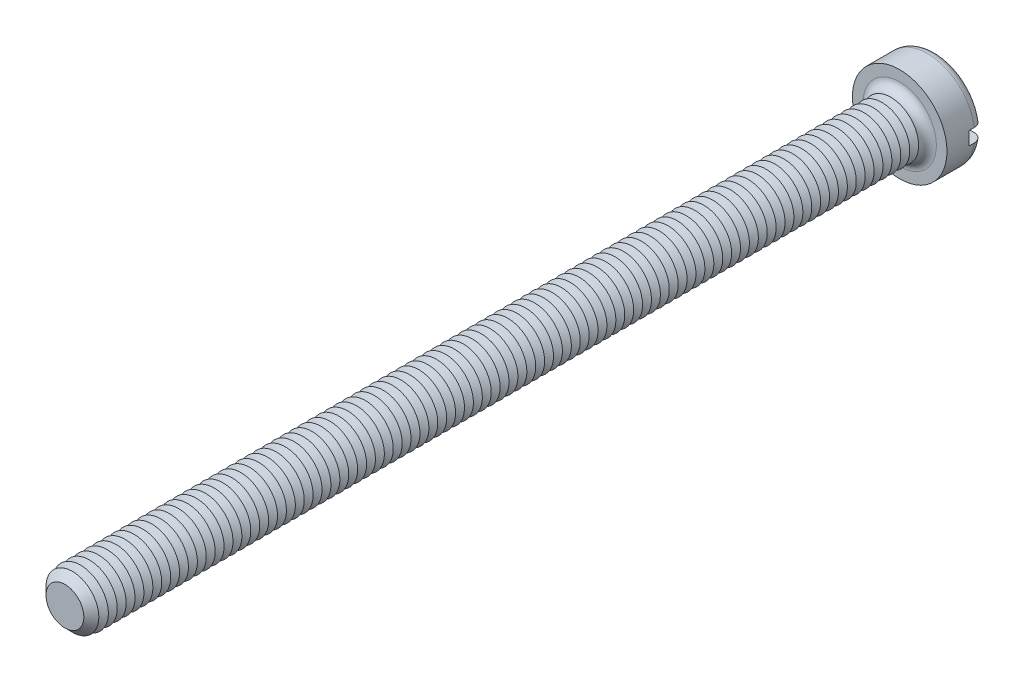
from build123d import *

# Parameters (mm, degrees)
SKETCH3_R           = 4.25
BOSS_EXTRUDE2_DEPTH = 3.3
SKETCH4_R           = 2.5
BOSS_EXTRUDE3_DEPTH = 75
FILLET1_R           = 0.8
CHAMFER1_SIZE       = 0.8
LPATTERN1_COUNT     = 92
LPATTERN1_PITCH     = 0.8
SKETCH8_W           = 8.5
SKETCH8_H           = 1.2
CUT_EXTRUDE1_DEPTH  = 1.3


with BuildPart() as part:
    # Sketch3 → Boss-Extrude2 (new body)
    with BuildSketch(Plane.XY):
        Circle(SKETCH3_R)
    extrude(amount=-BOSS_EXTRUDE2_DEPTH)

    # Sketch4 → Boss-Extrude3 (add)
    with BuildSketch(Plane.XY):
        Circle(SKETCH4_R)
    extrude(amount=BOSS_EXTRUDE3_DEPTH)

    # Fillet1
    fillet1_edges = [part.edges().sort_by_distance(p)[0] for p in [
        (-4.25, 0, -3.3),
        (-2.5, 0, 0),
    ]]
    fillet(fillet1_edges, radius=FILLET1_R)

    # Chamfer1
    chamfer1_edges = [part.edges().sort_by_distance(p)[0] for p in [
        (-2.5, 0, 75),
    ]]
    chamfer(chamfer1_edges, length=CHAMFER1_SIZE)

    # Sketch6 → Cut-Revolve1 (revolve, cut)
    with BuildSketch(Plane(origin=(0, 0, 0), x_dir=(0, 0, -1), z_dir=(1, 0, 0)), mode=Mode.PRIVATE) as cut_revolve1_sk:
        Polygon((-0.8, 2.5), (-1.2, 1.807179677), (-1.6, 2.5), align=None)
    cut_revolve1 = revolve(cut_revolve1_sk.sketch.rotate(Axis((0, 0, -1.694361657), (0, 0, 1)), 90), axis=Axis((0, 0, -1.694361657), (0, 0, 1)), mode=Mode.SUBTRACT)

    # LPattern1: Cut-Revolve1 ×92
    with Locations(*[(0, 0, i * LPATTERN1_PITCH) for i in range(1, LPATTERN1_COUNT)]):
        add(cut_revolve1, mode=Mode.SUBTRACT)

    # Sketch8 → Cut-Extrude1 (cut)
    with BuildSketch(Plane(origin=(0, 0, -3.3), x_dir=(-1, 0, 0), z_dir=(0, 0, -1))):
        Rectangle(SKETCH8_W, SKETCH8_H)
    extrude(amount=-CUT_EXTRUDE1_DEPTH, mode=Mode.SUBTRACT)


solid = part.part
